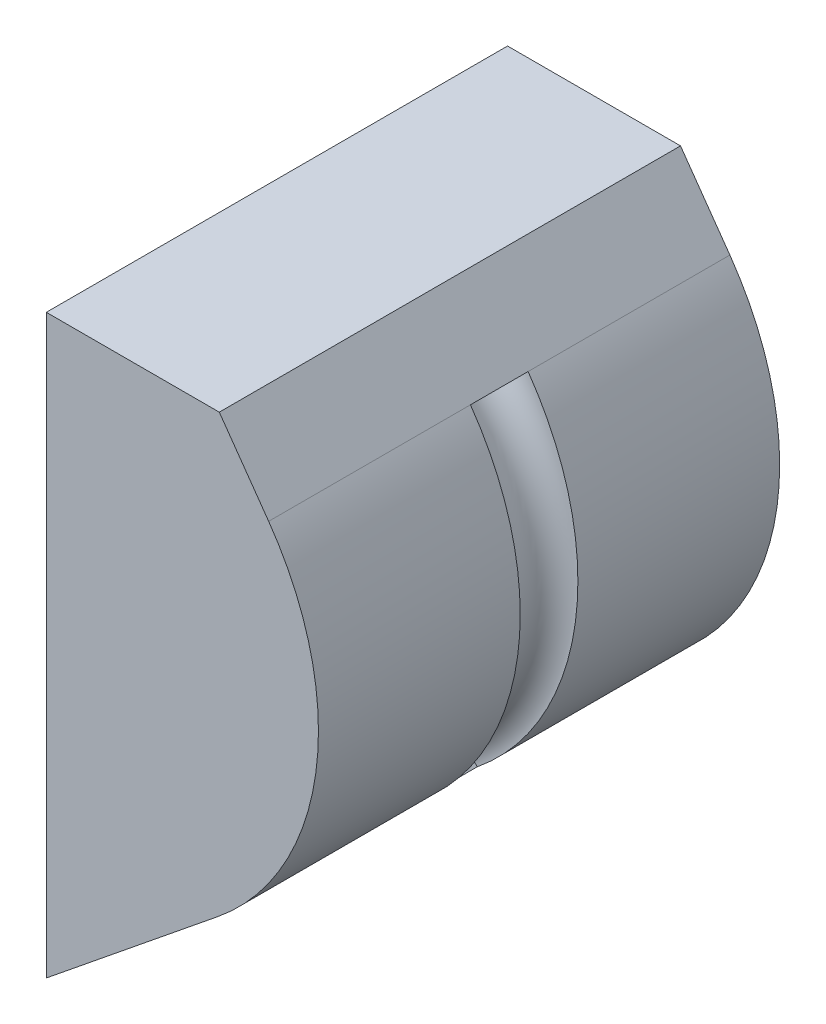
from build123d import *

# Parameters (mm, degrees)
EXTRUDE1_DEPTH = 40
SKETCH3_R      = 5


with BuildPart() as part:
    # Sketch1 → Extrude1 (new, symmetric)
    with BuildSketch(Plane.XY):
        with BuildLine():
            Line((0, 0), (30, 0))
            Line((30, 0), (38.563115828, -12.117632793))
            ThreePointArc((38.563115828, -12.117632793), (46.755580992, -45.757843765), (29.740759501, -75.912049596))
            Line((29.740759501, -75.912049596), (0, -100))
            Line((0, -100), (0, 0))
        make_face()
    extrude(amount=EXTRUDE1_DEPTH, both=True)

    # Cut-Sweep1: sweep along a path in Sketch2
    with BuildLine(Plane.XY) as cut_sweep1_path:
        ThreePointArc((29.740759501, -75.912049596), (46.755580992, -45.757843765), (38.563115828, -12.117632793))
    # Sketch3 → Cut-Sweep1 (sweep, cut)
    with BuildSketch(Plane(origin=(38.563115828, -12.117632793, 0), x_dir=(0, 0, 1), z_dir=(-0.5771101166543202, 0.8166663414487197, 0))):
        Circle(SKETCH3_R)
    sweep(path=cut_sweep1_path.line, mode=Mode.SUBTRACT)


solid = part.part
